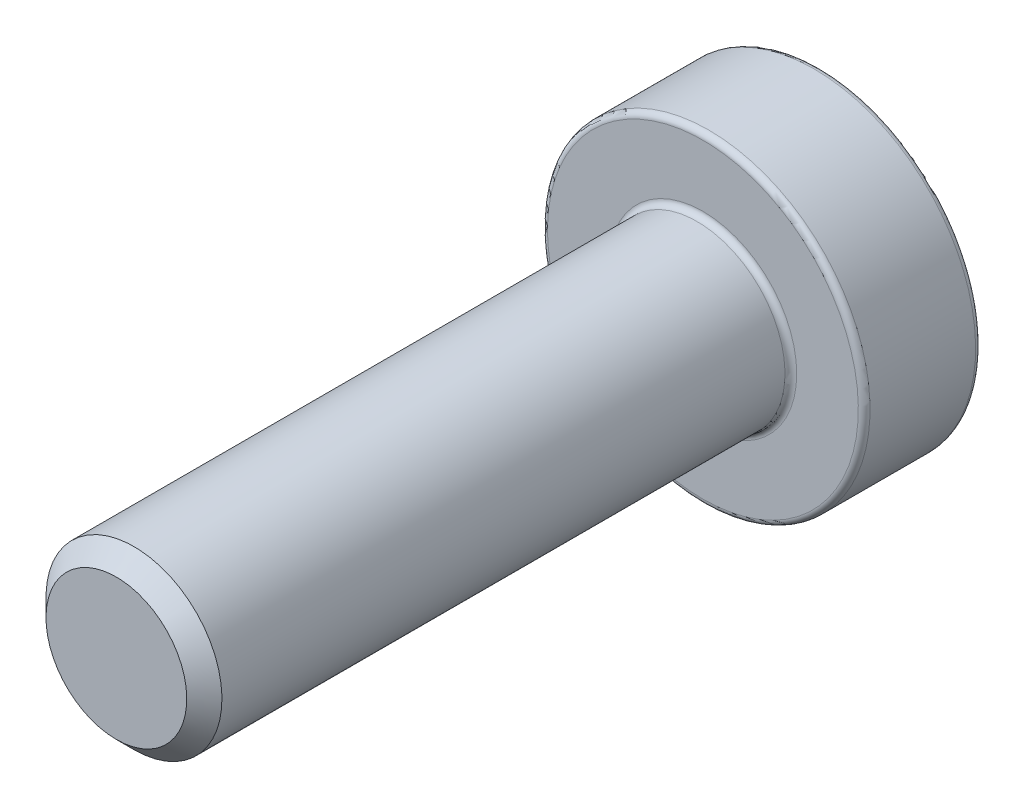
from build123d import *

# Parameters (mm, degrees)
FILLET1_R          = 0.1
HOLE1_D            = 2.05
HOLE1_DEPTH        = 1.1
HOLE1_TIP          = 0.37306949
CUT_EXTRUDE1_DEPTH = 1.1
CHANFREIN1_SIZE    = 0.3


with BuildPart() as part:
    # Sketch1 → Base-Revolve (revolve)
    with BuildSketch(Plane(origin=(0, 0, 0), x_dir=(0, 0, -1), z_dir=(1, 0, 0))):
        Polygon((-10, 0), (-10, 1.5), (0, 1.5), (0, 2.75), (2, 2.75), (2, 0), align=None)
    revolve(axis=Axis((0, 0, -2), (0, 0, 1)))

    # Fillet1
    fillet1_edges = [part.edges().sort_by_distance(p)[0] for p in [
        (0, -1.5, 0),
        (0, -2.75, 0),
        (0, -2.75, -2),
    ]]
    fillet(fillet1_edges, radius=FILLET1_R)

    # Hole1
    with Locations(Plane(origin=(0, 0, -2), x_dir=(-1, 0, 0), z_dir=(0, 0, -1))):
        with Locations((0, 0)):
            Hole(HOLE1_D / 2, depth=HOLE1_DEPTH)
            with Locations((0, 0, -(HOLE1_DEPTH + HOLE1_TIP / 2))):  # 140° drill point
                Cone(0, HOLE1_D / 2, HOLE1_TIP, mode=Mode.SUBTRACT)

    # Sketch5 → Cut-Extrude1 (cut)
    with BuildSketch(Plane(origin=(0, 0, -2), x_dir=(-1, 0, 0), z_dir=(0, 0, -1))):
        with BuildLine():
            ThreePointArc((1.075966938, -0.895709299), (1.212435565, -0.7), (1.313690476, -0.483960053))
            ThreePointArc((1.313690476, -0.483960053), (1.025, 0), (1.313690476, 0.483960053))
            ThreePointArc((1.313690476, 0.483960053), (1.212435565, 0.7), (1.075966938, 0.895709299))
            ThreePointArc((1.075966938, 0.895709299), (0.5125, 0.887676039), (0.237723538, 1.379669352))
            ThreePointArc((0.237723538, 1.379669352), (0, 1.4), (-0.237723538, 1.379669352))
            ThreePointArc((-0.237723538, 1.379669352), (-0.5125, 0.887676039), (-1.075966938, 0.895709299))
            ThreePointArc((-1.075966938, 0.895709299), (-1.212435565, 0.7), (-1.313690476, 0.483960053))
            ThreePointArc((-1.313690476, 0.483960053), (-1.025, 0), (-1.313690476, -0.483960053))
            ThreePointArc((-1.313690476, -0.483960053), (-1.212435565, -0.7), (-1.075966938, -0.895709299))
            ThreePointArc((-1.075966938, -0.895709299), (-0.5125, -0.887676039), (-0.237723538, -1.379669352))
            ThreePointArc((-0.237723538, -1.379669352), (0, -1.4), (0.237723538, -1.379669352))
            ThreePointArc((0.237723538, -1.379669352), (0.5125, -0.887676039), (1.075966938, -0.895709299))
        make_face()
    extrude(amount=-CUT_EXTRUDE1_DEPTH, mode=Mode.SUBTRACT)

    # Chanfrein1
    chanfrein1_edges = [part.edges().sort_by_distance(p)[0] for p in [
        (0, -1.5, 10),
    ]]
    chamfer(chanfrein1_edges, length=CHANFREIN1_SIZE)


solid = part.part
